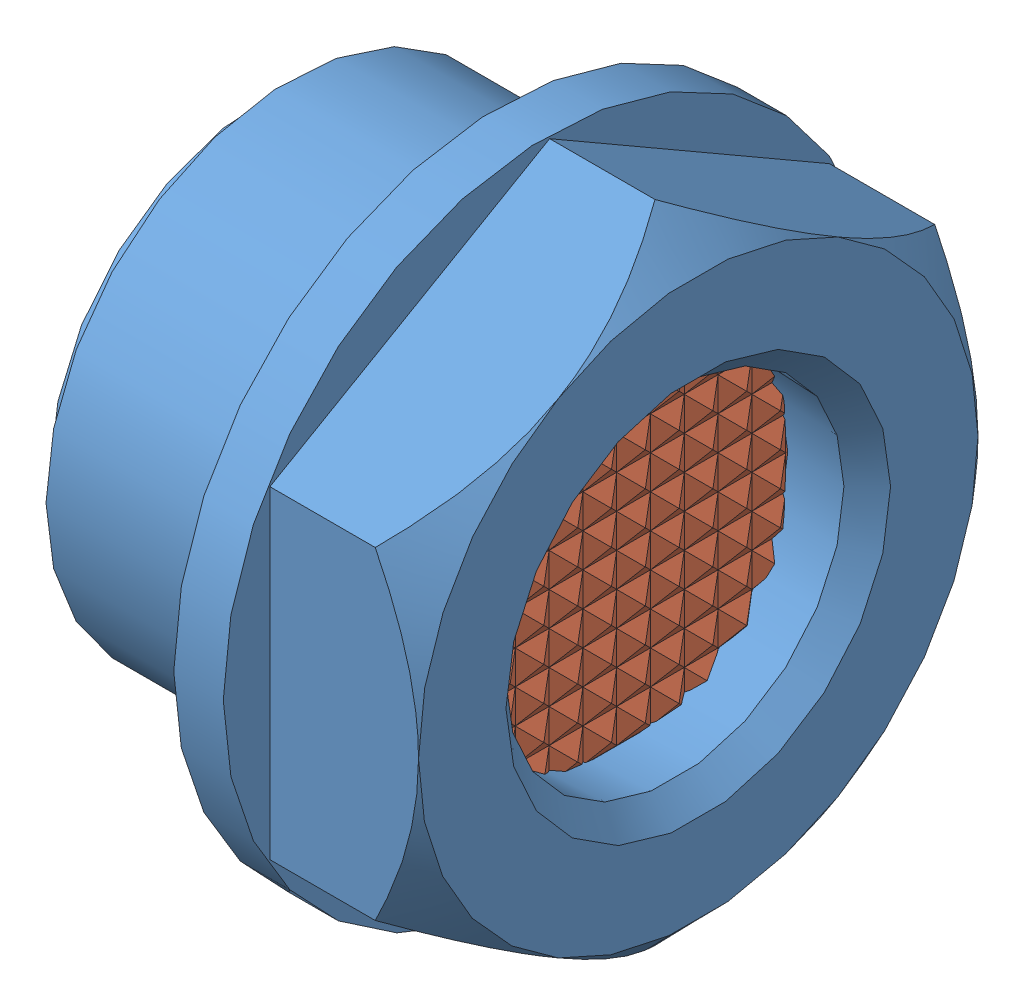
SolidWorks assembly 14462_Temp.SLDASM, configuration Default (file format 4100). Lengths in mm.
Overall size (18.5 30.48 28).
2 component instances, 2 part files, 0 mates.
Components (placement in the parent):
- 14462_01-1: 14462_01.SLDPRT [Default] at origin size (18.5 30.48 28)
- 14462_02-1: 14462_02.SLDPRT [Default] at origin size (1 16.11 16.11)
